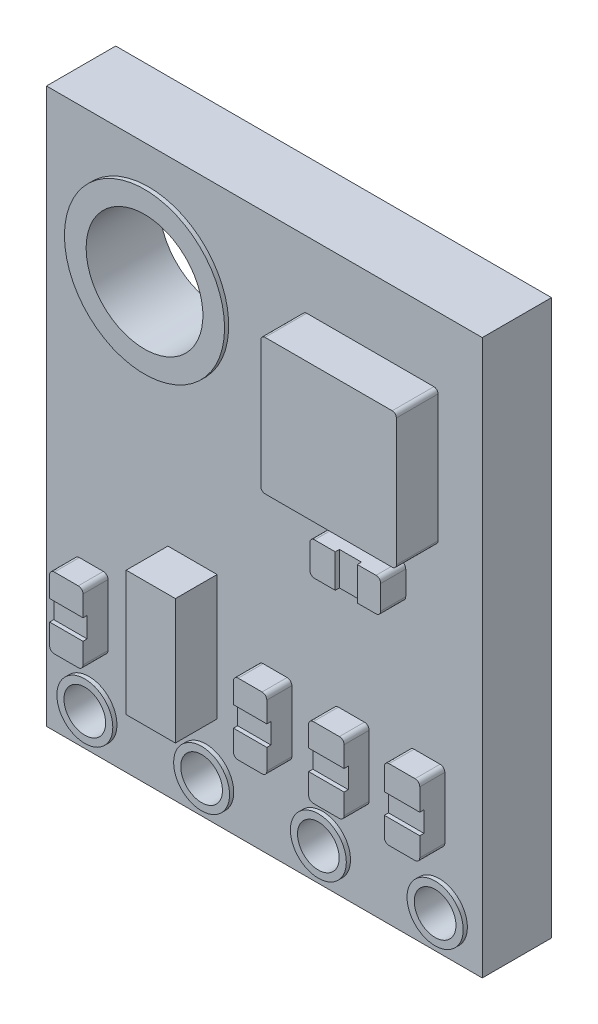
from build123d import *

# Parameters (mm, degrees)
CROQUIS1_W              = 10.45
CROQUIS1_H              = 13.3
CROQUIS1_R              = 1.4
SALIENTE_EXTRUIR1_DEPTH = 1.66
SALIENTE_EXTRUIR2_DEPTH = 1
SALIENTE_EXTRUIR3_DEPTH = 0.6
CROQUIS4_R              = 0.5
CORTAR_EXTRUIR1_DEPTH   = 2
CROQUIS5_W              = 1.18
CROQUIS5_H              = 3
SALIENTE_EXTRUIR4_DEPTH = 1
SALIENTE_EXTRUIR5_START = 0.1
CROQUIS6_R              = 0.670494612
CROQUIS6_R_2            = 0.5
CROQUIS6_R_3            = 0.673168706
CROQUIS6_R_4            = 1.920139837
CROQUIS6_R_5            = 1.4
SALIENTE_EXTRUIR5_DEPTH = 0.1
CROQUIS7_W              = 0.8
CROQUIS7_H              = 0.488253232
CROQUIS7_W_2            = 0.85
CROQUIS7_W_3            = 0.528941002
CROQUIS7_H_2            = 0.8
CORTAR_EXTRUIR2_DEPTH   = 0.1


with BuildPart() as part:
    # Croquis1 → Saliente-Extruir1 (new body)
    with BuildSketch(Plane.XY):
        Rectangle(CROQUIS1_W, CROQUIS1_H)
        with Locations(Location((-2.775, 3.86, 0), (0, 0, 180))):
            Circle(CROQUIS1_R, mode=Mode.SUBTRACT)
    extrude(amount=SALIENTE_EXTRUIR1_DEPTH)

    # Croquis2 → Saliente-Extruir2 (add)
    with BuildSketch(Plane.XY.offset(1.66)):
        with BuildLine():
            Line((1.014875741, 5.05), (4.064875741, 5.05))
            ThreePointArc((4.064875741, 5.05), (4.13558642, 5.020710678), (4.164875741, 4.95))
            Line((4.164875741, 4.95), (4.164875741, 1.9))
            ThreePointArc((4.164875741, 1.9), (4.13558642, 1.829289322), (4.064875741, 1.8))
            Line((4.064875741, 1.8), (1.014875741, 1.8))
            ThreePointArc((1.014875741, 1.8), (0.944165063, 1.829289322), (0.914875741, 1.9))
            Line((0.914875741, 1.9), (0.914875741, 4.95))
            ThreePointArc((0.914875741, 4.95), (0.944165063, 5.020710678), (1.014875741, 5.05))
        make_face()
    extrude(amount=SALIENTE_EXTRUIR2_DEPTH)

    # Croquis3 → Saliente-Extruir3 (add)
    with BuildSketch(Plane.XY.offset(1.66)):
        with BuildLine():
            Line((0.545086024, -4.450002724), (-0.029222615, -4.450002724))
            ThreePointArc((-0.029222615, -4.450002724), (-0.109016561, -4.41695099), (-0.142068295, -4.337157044))
            Line((-0.142068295, -4.337157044), (-0.142068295, -2.862848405))
            ThreePointArc((-0.142068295, -2.862848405), (-0.109016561, -2.783054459), (-0.029222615, -2.750002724))
            Line((-0.029222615, -2.750002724), (0.545086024, -2.750002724))
            ThreePointArc((0.545086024, -2.750002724), (0.62487997, -2.783054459), (0.657931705, -2.862848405))
            Line((0.657931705, -2.862848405), (0.657931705, -4.337157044))
            ThreePointArc((0.657931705, -4.337157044), (0.62487997, -4.41695099), (0.545086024, -4.450002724))
        make_face()
        with BuildLine():
            Line((-4.549824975, -4.337157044), (-4.549824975, -2.862848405))
            ThreePointArc((-4.549824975, -2.862848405), (-4.516773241, -2.783054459), (-4.436979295, -2.750002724))
            Line((-4.436979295, -2.750002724), (-3.862670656, -2.750002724))
            ThreePointArc((-3.862670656, -2.750002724), (-3.78287671, -2.783054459), (-3.749824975, -2.862848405))
            Line((-3.749824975, -2.862848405), (-3.749824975, -4.337157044))
            ThreePointArc((-3.749824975, -4.337157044), (-3.78287671, -4.41695099), (-3.862670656, -4.450002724))
            Line((-3.862670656, -4.450002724), (-4.436979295, -4.450002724))
            ThreePointArc((-4.436979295, -4.450002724), (-4.516773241, -4.41695099), (-4.549824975, -4.337157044))
        make_face()
        with BuildLine():
            Line((3.58895412, -2.716727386), (4.213262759, -2.716727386))
            ThreePointArc((4.213262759, -2.716727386), (4.293056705, -2.749779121), (4.32610844, -2.829573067))
            Line((4.32610844, -2.829573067), (4.32610844, -4.303881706))
            ThreePointArc((4.32610844, -4.303881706), (4.293056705, -4.383675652), (4.213262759, -4.416727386))
            Line((4.213262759, -4.416727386), (3.58895412, -4.416727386))
            ThreePointArc((3.58895412, -4.416727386), (3.509160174, -4.383675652), (3.47610844, -4.303881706))
            Line((3.47610844, -4.303881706), (3.47610844, -2.829573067))
            ThreePointArc((3.47610844, -2.829573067), (3.509160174, -2.749779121), (3.58895412, -2.716727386))
        make_face()
        with BuildLine():
            Line((1.661189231, -4.337157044), (1.661189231, -2.862848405))
            ThreePointArc((1.661189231, -2.862848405), (1.694240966, -2.783054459), (1.774034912, -2.750002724))
            Line((1.774034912, -2.750002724), (2.398343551, -2.750002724))
            ThreePointArc((2.398343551, -2.750002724), (2.478137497, -2.783054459), (2.511189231, -2.862848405))
            Line((2.511189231, -2.862848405), (2.511189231, -4.337157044))
            ThreePointArc((2.511189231, -4.337157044), (2.478137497, -4.41695099), (2.398343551, -4.450002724))
            Line((2.398343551, -4.450002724), (1.774034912, -4.450002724))
            ThreePointArc((1.774034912, -4.450002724), (1.694240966, -4.41695099), (1.661189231, -4.337157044))
        make_face()
        with BuildLine():
            Line((1.689875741, 0.350979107), (1.689875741, 0.925287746))
            ThreePointArc((1.689875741, 0.925287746), (1.722927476, 1.005081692), (1.802721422, 1.038133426))
            Line((1.802721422, 1.038133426), (3.277030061, 1.038133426))
            ThreePointArc((3.277030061, 1.038133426), (3.356824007, 1.005081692), (3.389875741, 0.925287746))
            Line((3.389875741, 0.925287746), (3.389875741, 0.350979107))
            ThreePointArc((3.389875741, 0.350979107), (3.356824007, 0.271185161), (3.277030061, 0.238133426))
            Line((3.277030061, 0.238133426), (1.802721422, 0.238133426))
            ThreePointArc((1.802721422, 0.238133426), (1.722927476, 0.271185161), (1.689875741, 0.350979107))
        make_face()
    extrude(amount=SALIENTE_EXTRUIR3_DEPTH)

    # Croquis4 → Cortar-Extruir1 (cut)
    with BuildSketch(Plane.XY.offset(1.66)):
        with Locations((4.194245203, -5.773988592)):
            Circle(CROQUIS4_R)
        with Locations((1.394245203, -5.773988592)):
            Circle(CROQUIS4_R)
        with Locations((-1.405754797, -5.773988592)):
            Circle(CROQUIS4_R)
        with Locations((-4.205754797, -5.773988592)):
            Circle(CROQUIS4_R)
    extrude(amount=-CORTAR_EXTRUIR1_DEPTH, mode=Mode.SUBTRACT)

    # Croquis5 → Saliente-Extruir4 (add)
    with BuildSketch(Plane.XY.offset(1.66)):
        with Locations((-1.72406111, -2.950002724)):
            Rectangle(CROQUIS5_W, CROQUIS5_H)
    extrude(amount=SALIENTE_EXTRUIR4_DEPTH)

    # Croquis6 → Saliente-Extruir5 (add)
    # profile 1 of 5: a face of its own
    with BuildSketch(Plane.XY.offset(1.66).offset(SALIENTE_EXTRUIR5_START)):
        with Locations(Location((-4.205754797, -5.773988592, 0), (0, 0, 180))):
            Circle(CROQUIS6_R)
        with Locations((-4.205754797, -5.773988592)):
            Circle(CROQUIS6_R_2, mode=Mode.SUBTRACT)
    # profile 2 of 5: a face of its own
    with BuildSketch(Plane.XY.offset(1.66).offset(SALIENTE_EXTRUIR5_START)):
        with Locations(Location((-1.405754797, -5.773988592, 0), (0, 0, 180))):
            Circle(CROQUIS6_R)
        with Locations((-1.405754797, -5.773988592)):
            Circle(CROQUIS6_R_2, mode=Mode.SUBTRACT)
    # profile 3 of 5: a face of its own
    with BuildSketch(Plane.XY.offset(1.66).offset(SALIENTE_EXTRUIR5_START)):
        with Locations(Location((1.394245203, -5.773988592, 0), (0, 0, 180))):
            Circle(CROQUIS6_R)
        with Locations((1.394245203, -5.773988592)):
            Circle(CROQUIS6_R_2, mode=Mode.SUBTRACT)
    # profile 4 of 5: a face of its own
    with BuildSketch(Plane.XY.offset(1.66).offset(SALIENTE_EXTRUIR5_START)):
        with Locations(Location((4.194245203, -5.773988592, 0), (0, 0, 180))):
            Circle(CROQUIS6_R_3)
        with Locations((4.194245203, -5.773988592)):
            Circle(CROQUIS6_R_2, mode=Mode.SUBTRACT)
    # profile 5 of 5: a face of its own
    with BuildSketch(Plane.XY.offset(1.66).offset(SALIENTE_EXTRUIR5_START)):
        with Locations(Location((-2.775, 3.86, 0), (0, 0, 180))):
            Circle(CROQUIS6_R_4)
        with Locations(Location((-2.775, 3.86, 0), (0, 0, 180))):
            Circle(CROQUIS6_R_5, mode=Mode.SUBTRACT)
    extrude(amount=-SALIENTE_EXTRUIR5_DEPTH)

    # Croquis7 → Cortar-Extruir2 (cut)
    with BuildSketch(Plane.XY.offset(2.26)):
        with Locations((-4.149824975, -3.600867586)):
            Rectangle(CROQUIS7_W, CROQUIS7_H)
        with Locations((0.257931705, -3.600867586)):
            Rectangle(CROQUIS7_W, CROQUIS7_H)
        with Locations((2.086189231, -3.600867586)):
            Rectangle(CROQUIS7_W_2, CROQUIS7_H)
        with Locations((3.90110844, -3.600867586)):
            Rectangle(CROQUIS7_W_2, CROQUIS7_H)
        with Locations((2.563329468, 0.638133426)):
            Rectangle(CROQUIS7_W_3, CROQUIS7_H_2)
    extrude(amount=-CORTAR_EXTRUIR2_DEPTH, mode=Mode.SUBTRACT)


solid = part.part
